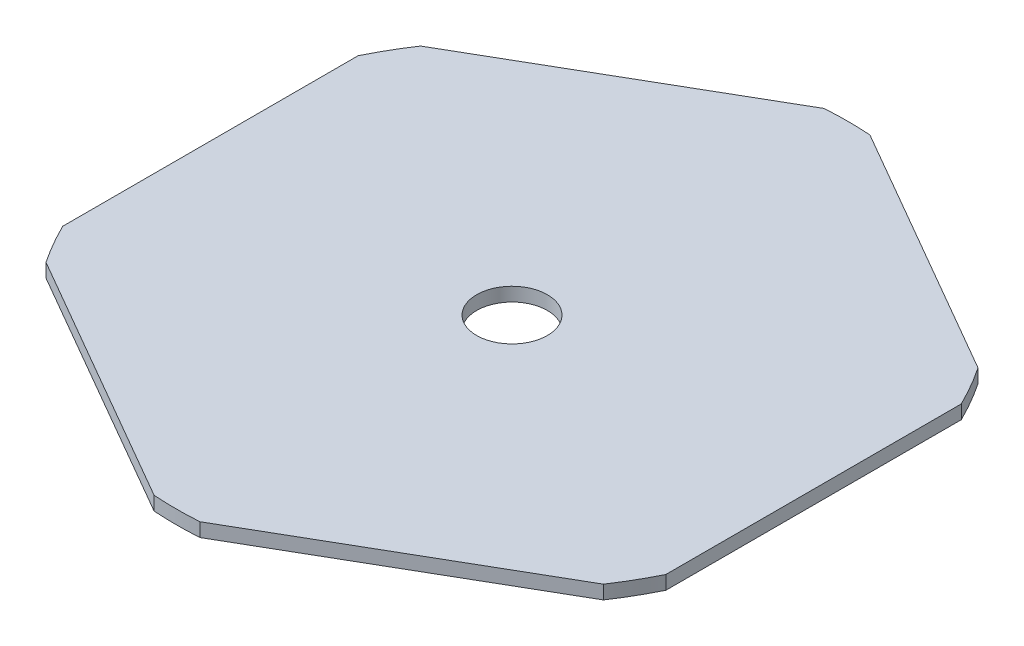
ISO-10303-21;
HEADER;
FILE_DESCRIPTION(('STEP AP214'),'2;1');
FILE_NAME('part.step','',(''),(''),'','','');
FILE_SCHEMA(('AUTOMOTIVE_DESIGN { 1 0 10303 214 1 1 1 1 }'));
ENDSEC;
DATA;
#1=APPLICATION_CONTEXT('core data for automotive mechanical design processes');
#2=APPLICATION_PROTOCOL_DEFINITION('international standard','automotive_design',2000,#1);
#3=PRODUCT_CONTEXT('',#1,'mechanical');
#4=PRODUCT('Part','Part','',(#3));
#5=PRODUCT_RELATED_PRODUCT_CATEGORY('part','',(#4));
#6=PRODUCT_DEFINITION_FORMATION('','',#4);
#7=PRODUCT_DEFINITION_CONTEXT('part definition',#1,'design');
#8=PRODUCT_DEFINITION('design','',#6,#7);
#9=PRODUCT_DEFINITION_SHAPE('','',#8);
#10=(LENGTH_UNIT() NAMED_UNIT(*) SI_UNIT(.MILLI.,.METRE.));
#11=(NAMED_UNIT(*) PLANE_ANGLE_UNIT() SI_UNIT($,.RADIAN.));
#12=(NAMED_UNIT(*) SI_UNIT($,.STERADIAN.) SOLID_ANGLE_UNIT());
#13=UNCERTAINTY_MEASURE_WITH_UNIT(LENGTH_MEASURE(1.E-05),#10,'distance_accuracy_value','');
#14=(GEOMETRIC_REPRESENTATION_CONTEXT(3) GLOBAL_UNCERTAINTY_ASSIGNED_CONTEXT((#13)) GLOBAL_UNIT_ASSIGNED_CONTEXT((#10,
#11,#12)) REPRESENTATION_CONTEXT('',''));
#15=CARTESIAN_POINT('',(0.,0.,0.));
#16=DIRECTION('',(0.,0.,1.));
#17=DIRECTION('',(1.,0.,0.));
#18=AXIS2_PLACEMENT_3D('',#15,#16,#17);
#19=CARTESIAN_POINT('',(0.,6.35,0.));
#20=DIRECTION('',(0.,-1.,0.));
#21=DIRECTION('',(0.,0.,-1.));
#22=AXIS2_PLACEMENT_3D('',#19,#20,#21);
#23=CYLINDRICAL_SURFACE('',#22,155.575);
#24=CARTESIAN_POINT('',(0.,6.35,0.));
#25=DIRECTION('',(0.,1.,0.));
#26=DIRECTION('',(0.,0.,1.));
#27=AXIS2_PLACEMENT_3D('',#24,#25,#26);
#28=CIRCLE('',#27,155.575);
#29=CARTESIAN_POINT('',(139.718923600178,6.35,-68.4266250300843));
#30=VERTEX_POINT('',#29);
#31=CARTESIAN_POINT('',(129.118657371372,6.35,-86.7868247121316));
#32=VERTEX_POINT('',#31);
#33=EDGE_CURVE('E256',#30,#32,#28,.T.);
#34=ORIENTED_EDGE('',*,*,#33,.F.);
#35=DIRECTION('',(0.,-1.,0.));
#36=VECTOR('',#35,1.);
#37=CARTESIAN_POINT('',(139.718923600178,6.35,-68.4266250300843));
#38=LINE('',#37,#36);
#39=CARTESIAN_POINT('',(139.718923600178,0.,-68.4266250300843));
#40=VERTEX_POINT('',#39);
#41=EDGE_CURVE('E220',#30,#40,#38,.T.);
#42=ORIENTED_EDGE('',*,*,#41,.T.);
#43=CARTESIAN_POINT('',(0.,0.,0.));
#44=DIRECTION('',(0.,1.,0.));
#45=DIRECTION('',(0.,0.,1.));
#46=AXIS2_PLACEMENT_3D('',#43,#44,#45);
#47=CIRCLE('',#46,155.575);
#48=CARTESIAN_POINT('',(129.118657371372,0.,-86.7868247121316));
#49=VERTEX_POINT('',#48);
#50=EDGE_CURVE('E173',#40,#49,#47,.T.);
#51=ORIENTED_EDGE('',*,*,#50,.T.);
#52=DIRECTION('',(0.,-1.,0.));
#53=VECTOR('',#52,1.);
#54=CARTESIAN_POINT('',(129.118657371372,6.35,-86.7868247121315));
#55=LINE('',#54,#53);
#56=EDGE_CURVE('E213',#49,#32,#55,.F.);
#57=ORIENTED_EDGE('',*,*,#56,.T.);
#58=EDGE_LOOP('',(#34,#42,#51,#57));
#59=FACE_BOUND('',#58,.T.);
#60=ADVANCED_FACE('F44',(#59),#23,.T.);
#61=CARTESIAN_POINT('',(10.6002662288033,6.35,-155.213449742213));
#62=VERTEX_POINT('',#61);
#63=CARTESIAN_POINT('',(-10.6002662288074,6.35,-155.213449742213));
#64=VERTEX_POINT('',#63);
#65=EDGE_CURVE('E217',#62,#64,#28,.T.);
#66=ORIENTED_EDGE('',*,*,#65,.F.);
#67=DIRECTION('',(0.,-1.,0.));
#68=VECTOR('',#67,1.);
#69=CARTESIAN_POINT('',(10.6002662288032,6.35,-155.213449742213));
#70=LINE('',#69,#68);
#71=CARTESIAN_POINT('',(10.6002662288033,0.,-155.213449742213));
#72=VERTEX_POINT('',#71);
#73=EDGE_CURVE('E211',#62,#72,#70,.T.);
#74=ORIENTED_EDGE('',*,*,#73,.T.);
#75=CARTESIAN_POINT('',(-10.6002662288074,0.,-155.213449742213));
#76=VERTEX_POINT('',#75);
#77=EDGE_CURVE('E181',#72,#76,#47,.T.);
#78=ORIENTED_EDGE('',*,*,#77,.T.);
#79=DIRECTION('',(0.,-1.,0.));
#80=VECTOR('',#79,1.);
#81=CARTESIAN_POINT('',(-10.6002662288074,6.35,-155.213449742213));
#82=LINE('',#81,#80);
#83=EDGE_CURVE('E278',#76,#64,#82,.F.);
#84=ORIENTED_EDGE('',*,*,#83,.T.);
#85=EDGE_LOOP('',(#66,#74,#78,#84));
#86=FACE_BOUND('',#85,.T.);
#87=ADVANCED_FACE('F215',(#86),#23,.T.);
#88=CARTESIAN_POINT('',(-129.118657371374,6.35,-86.7868247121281));
#89=VERTEX_POINT('',#88);
#90=CARTESIAN_POINT('',(-139.718923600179,6.35,-68.4266250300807));
#91=VERTEX_POINT('',#90);
#92=EDGE_CURVE('E258',#89,#91,#28,.T.);
#93=ORIENTED_EDGE('',*,*,#92,.F.);
#94=DIRECTION('',(0.,-1.,0.));
#95=VECTOR('',#94,1.);
#96=CARTESIAN_POINT('',(-129.118657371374,6.35,-86.7868247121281));
#97=LINE('',#96,#95);
#98=CARTESIAN_POINT('',(-129.118657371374,0.,-86.7868247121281));
#99=VERTEX_POINT('',#98);
#100=EDGE_CURVE('E198',#89,#99,#97,.T.);
#101=ORIENTED_EDGE('',*,*,#100,.T.);
#102=CARTESIAN_POINT('',(-139.718923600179,0.,-68.4266250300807));
#103=VERTEX_POINT('',#102);
#104=EDGE_CURVE('E166',#99,#103,#47,.T.);
#105=ORIENTED_EDGE('',*,*,#104,.T.);
#106=DIRECTION('',(0.,-1.,0.));
#107=VECTOR('',#106,1.);
#108=CARTESIAN_POINT('',(-139.718923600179,6.35,-68.4266250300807));
#109=LINE('',#108,#107);
#110=EDGE_CURVE('E70',#103,#91,#109,.F.);
#111=ORIENTED_EDGE('',*,*,#110,.T.);
#112=EDGE_LOOP('',(#93,#101,#105,#111));
#113=FACE_BOUND('',#112,.T.);
#114=ADVANCED_FACE('F196',(#113),#23,.T.);
#115=CARTESIAN_POINT('',(-139.718923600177,6.35,68.4266250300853));
#116=VERTEX_POINT('',#115);
#117=CARTESIAN_POINT('',(-129.118657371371,6.35,86.7868247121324));
#118=VERTEX_POINT('',#117);
#119=EDGE_CURVE('E177',#116,#118,#28,.T.);
#120=ORIENTED_EDGE('',*,*,#119,.F.);
#121=DIRECTION('',(0.,-1.,0.));
#122=VECTOR('',#121,1.);
#123=CARTESIAN_POINT('',(-139.718923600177,6.35,68.4266250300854));
#124=LINE('',#123,#122);
#125=CARTESIAN_POINT('',(-139.718923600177,0.,68.4266250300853));
#126=VERTEX_POINT('',#125);
#127=EDGE_CURVE('E267',#116,#126,#124,.T.);
#128=ORIENTED_EDGE('',*,*,#127,.T.);
#129=CARTESIAN_POINT('',(-129.118657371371,0.,86.7868247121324));
#130=VERTEX_POINT('',#129);
#131=EDGE_CURVE('E161',#126,#130,#47,.T.);
#132=ORIENTED_EDGE('',*,*,#131,.T.);
#133=DIRECTION('',(0.,-1.,0.));
#134=VECTOR('',#133,1.);
#135=CARTESIAN_POINT('',(-129.118657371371,6.35,86.7868247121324));
#136=LINE('',#135,#134);
#137=EDGE_CURVE('E62',#130,#118,#136,.F.);
#138=ORIENTED_EDGE('',*,*,#137,.T.);
#139=EDGE_LOOP('',(#120,#128,#132,#138));
#140=FACE_BOUND('',#139,.T.);
#141=ADVANCED_FACE('F266',(#140),#23,.T.);
#142=CARTESIAN_POINT('',(-10.6002662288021,6.35,155.213449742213));
#143=VERTEX_POINT('',#142);
#144=CARTESIAN_POINT('',(10.6002662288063,6.35,155.213449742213));
#145=VERTEX_POINT('',#144);
#146=EDGE_CURVE('E155',#143,#145,#28,.T.);
#147=ORIENTED_EDGE('',*,*,#146,.F.);
#148=DIRECTION('',(0.,-1.,0.));
#149=VECTOR('',#148,1.);
#150=CARTESIAN_POINT('',(-10.6002662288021,6.35,155.213449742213));
#151=LINE('',#150,#149);
#152=CARTESIAN_POINT('',(-10.6002662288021,0.,155.213449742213));
#153=VERTEX_POINT('',#152);
#154=EDGE_CURVE('E139',#143,#153,#151,.T.);
#155=ORIENTED_EDGE('',*,*,#154,.T.);
#156=CARTESIAN_POINT('',(10.6002662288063,0.,155.213449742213));
#157=VERTEX_POINT('',#156);
#158=EDGE_CURVE('E153',#153,#157,#47,.T.);
#159=ORIENTED_EDGE('',*,*,#158,.T.);
#160=DIRECTION('',(0.,-1.,0.));
#161=VECTOR('',#160,1.);
#162=CARTESIAN_POINT('',(10.6002662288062,6.35,155.213449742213));
#163=LINE('',#162,#161);
#164=EDGE_CURVE('E230',#157,#145,#163,.F.);
#165=ORIENTED_EDGE('',*,*,#164,.T.);
#166=EDGE_LOOP('',(#147,#155,#159,#165));
#167=FACE_BOUND('',#166,.T.);
#168=ADVANCED_FACE('F151',(#167),#23,.T.);
#169=CARTESIAN_POINT('',(129.118657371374,0.,86.786824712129));
#170=VERTEX_POINT('',#169);
#171=CARTESIAN_POINT('',(139.718923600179,0.,68.4266250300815));
#172=VERTEX_POINT('',#171);
#173=EDGE_CURVE('E164',#170,#172,#47,.T.);
#174=ORIENTED_EDGE('',*,*,#173,.T.);
#175=DIRECTION('',(0.,-1.,0.));
#176=VECTOR('',#175,1.);
#177=CARTESIAN_POINT('',(139.718923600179,6.35,68.4266250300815));
#178=LINE('',#177,#176);
#179=CARTESIAN_POINT('',(139.718923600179,6.35,68.4266250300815));
#180=VERTEX_POINT('',#179);
#181=EDGE_CURVE('E218',#172,#180,#178,.F.);
#182=ORIENTED_EDGE('',*,*,#181,.T.);
#183=CARTESIAN_POINT('',(129.118657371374,6.35,86.786824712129));
#184=VERTEX_POINT('',#183);
#185=EDGE_CURVE('E178',#184,#180,#28,.T.);
#186=ORIENTED_EDGE('',*,*,#185,.F.);
#187=DIRECTION('',(0.,-1.,0.));
#188=VECTOR('',#187,1.);
#189=CARTESIAN_POINT('',(129.118657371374,6.35,86.7868247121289));
#190=LINE('',#189,#188);
#191=EDGE_CURVE('E232',#184,#170,#190,.T.);
#192=ORIENTED_EDGE('',*,*,#191,.T.);
#193=EDGE_LOOP('',(#174,#182,#186,#192));
#194=FACE_BOUND('',#193,.T.);
#195=ADVANCED_FACE('F46',(#194),#23,.T.);
#196=CARTESIAN_POINT('',(0.,6.35,0.));
#197=DIRECTION('',(0.,1.,0.));
#198=DIRECTION('',(0.,0.,1.));
#199=AXIS2_PLACEMENT_3D('',#196,#197,#198);
#200=PLANE('',#199);
#201=DIRECTION('',(0.,0.,1.));
#202=VECTOR('',#201,1.);
#203=CARTESIAN_POINT('',(139.718923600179,6.35,116.509208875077));
#204=LINE('',#203,#202);
#205=EDGE_CURVE('E269',#30,#180,#204,.T.);
#206=ORIENTED_EDGE('',*,*,#205,.F.);
#207=ORIENTED_EDGE('',*,*,#33,.T.);
#208=DIRECTION('',(0.866025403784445,0.,0.499999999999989));
#209=VECTOR('',#208,1.);
#210=CARTESIAN_POINT('',(170.759396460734,6.35,-62.7455327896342));
#211=LINE('',#210,#209);
#212=EDGE_CURVE('E272',#62,#32,#211,.T.);
#213=ORIENTED_EDGE('',*,*,#212,.F.);
#214=ORIENTED_EDGE('',*,*,#65,.T.);
#215=DIRECTION('',(0.866025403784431,0.,-0.500000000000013));
#216=VECTOR('',#215,1.);
#217=CARTESIAN_POINT('',(31.0404728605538,6.35,-179.254741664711));
#218=LINE('',#217,#216);
#219=EDGE_CURVE('E281',#89,#64,#218,.T.);
#220=ORIENTED_EDGE('',*,*,#219,.F.);
#221=ORIENTED_EDGE('',*,*,#92,.T.);
#222=DIRECTION('',(0.,0.,-1.));
#223=VECTOR('',#222,1.);
#224=CARTESIAN_POINT('',(-139.71892360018,6.35,-116.509208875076));
#225=LINE('',#224,#223);
#226=EDGE_CURVE('E264',#116,#91,#225,.T.);
#227=ORIENTED_EDGE('',*,*,#226,.F.);
#228=ORIENTED_EDGE('',*,*,#119,.T.);
#229=DIRECTION('',(-0.866025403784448,0.,-0.499999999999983));
#230=VECTOR('',#229,1.);
#231=CARTESIAN_POINT('',(-170.759396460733,6.35,62.7455327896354));
#232=LINE('',#231,#230);
#233=EDGE_CURVE('E263',#143,#118,#232,.T.);
#234=ORIENTED_EDGE('',*,*,#233,.F.);
#235=ORIENTED_EDGE('',*,*,#146,.T.);
#236=DIRECTION('',(-0.866025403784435,0.,0.500000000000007));
#237=VECTOR('',#236,1.);
#238=CARTESIAN_POINT('',(-31.0404728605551,6.35,179.254741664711));
#239=LINE('',#238,#237);
#240=EDGE_CURVE('E227',#184,#145,#239,.T.);
#241=ORIENTED_EDGE('',*,*,#240,.F.);
#242=ORIENTED_EDGE('',*,*,#185,.T.);
#243=EDGE_LOOP('',(#206,#207,#213,#214,#220,#221,#227,#228,#234,#235,#241,#242));
#244=FACE_BOUND('',#243,.T.);
#245=CARTESIAN_POINT('',(0.,6.35,0.));
#246=DIRECTION('',(0.,1.,0.));
#247=DIRECTION('',(0.,0.,1.));
#248=AXIS2_PLACEMENT_3D('',#245,#246,#247);
#249=CIRCLE('',#248,16.383);
#250=CARTESIAN_POINT('',(0.,6.35,16.383));
#251=VERTEX_POINT('',#250);
#252=EDGE_CURVE('E169',#251,#251,#249,.T.);
#253=ORIENTED_EDGE('',*,*,#252,.F.);
#254=EDGE_LOOP('',(#253));
#255=FACE_BOUND('',#254,.T.);
#256=ADVANCED_FACE('F240',(#244,#255),#200,.T.);
#257=CARTESIAN_POINT('',(0.,0.,0.));
#258=DIRECTION('',(0.,1.,0.));
#259=DIRECTION('',(0.,0.,1.));
#260=AXIS2_PLACEMENT_3D('',#257,#258,#259);
#261=PLANE('',#260);
#262=CARTESIAN_POINT('',(0.,0.,0.));
#263=DIRECTION('',(0.,1.,0.));
#264=DIRECTION('',(0.,0.,1.));
#265=AXIS2_PLACEMENT_3D('',#262,#263,#264);
#266=CIRCLE('',#265,16.383);
#267=CARTESIAN_POINT('',(0.,0.,16.383));
#268=VERTEX_POINT('',#267);
#269=EDGE_CURVE('E162',#268,#268,#266,.T.);
#270=ORIENTED_EDGE('',*,*,#269,.T.);
#271=EDGE_LOOP('',(#270));
#272=FACE_BOUND('',#271,.T.);
#273=ORIENTED_EDGE('',*,*,#50,.F.);
#274=DIRECTION('',(0.,0.,1.));
#275=VECTOR('',#274,1.);
#276=CARTESIAN_POINT('',(139.718923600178,0.,-1.38056057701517E-12));
#277=LINE('',#276,#275);
#278=EDGE_CURVE('E11',#40,#172,#277,.T.);
#279=ORIENTED_EDGE('',*,*,#278,.T.);
#280=ORIENTED_EDGE('',*,*,#173,.F.);
#281=DIRECTION('',(-0.866025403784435,0.,0.500000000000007));
#282=VECTOR('',#281,1.);
#283=CARTESIAN_POINT('',(69.85946180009,0.,121.000137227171));
#284=LINE('',#283,#282);
#285=EDGE_CURVE('E147',#170,#157,#284,.T.);
#286=ORIENTED_EDGE('',*,*,#285,.T.);
#287=ORIENTED_EDGE('',*,*,#158,.F.);
#288=DIRECTION('',(-0.866025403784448,0.,-0.499999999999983));
#289=VECTOR('',#288,1.);
#290=CARTESIAN_POINT('',(-69.8594618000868,0.,121.000137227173));
#291=LINE('',#290,#289);
#292=EDGE_CURVE('E136',#153,#130,#291,.T.);
#293=ORIENTED_EDGE('',*,*,#292,.T.);
#294=ORIENTED_EDGE('',*,*,#131,.F.);
#295=DIRECTION('',(0.,0.,-1.));
#296=VECTOR('',#295,1.);
#297=CARTESIAN_POINT('',(-139.718923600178,0.,2.35781132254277E-12));
#298=LINE('',#297,#296);
#299=EDGE_CURVE('E146',#126,#103,#298,.T.);
#300=ORIENTED_EDGE('',*,*,#299,.T.);
#301=ORIENTED_EDGE('',*,*,#104,.F.);
#302=DIRECTION('',(0.866025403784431,0.,-0.500000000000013));
#303=VECTOR('',#302,1.);
#304=CARTESIAN_POINT('',(-69.8594618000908,0.,-121.00013722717));
#305=LINE('',#304,#303);
#306=EDGE_CURVE('E200',#99,#76,#305,.T.);
#307=ORIENTED_EDGE('',*,*,#306,.T.);
#308=ORIENTED_EDGE('',*,*,#77,.F.);
#309=DIRECTION('',(0.866025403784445,0.,0.49999999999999));
#310=VECTOR('',#309,1.);
#311=CARTESIAN_POINT('',(69.8594618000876,0.,-121.000137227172));
#312=LINE('',#311,#310);
#313=EDGE_CURVE('E53',#72,#49,#312,.T.);
#314=ORIENTED_EDGE('',*,*,#313,.T.);
#315=EDGE_LOOP('',(#273,#279,#280,#286,#287,#293,#294,#300,#301,#307,#308,#314));
#316=FACE_BOUND('',#315,.T.);
#317=ADVANCED_FACE('F159',(#272,#316),#261,.F.);
#318=CARTESIAN_POINT('',(0.,0.,0.));
#319=DIRECTION('',(0.,1.,0.));
#320=DIRECTION('',(0.,0.,1.));
#321=AXIS2_PLACEMENT_3D('',#318,#319,#320);
#322=CYLINDRICAL_SURFACE('',#321,16.383);
#323=ORIENTED_EDGE('',*,*,#269,.F.);
#324=EDGE_LOOP('',(#323));
#325=FACE_BOUND('',#324,.T.);
#326=ORIENTED_EDGE('',*,*,#252,.T.);
#327=EDGE_LOOP('',(#326));
#328=FACE_BOUND('',#327,.T.);
#329=ADVANCED_FACE('F238',(#325,#328),#322,.F.);
#330=CARTESIAN_POINT('',(-31.0404728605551,0.,179.254741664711));
#331=DIRECTION('',(-0.500000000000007,0.,-0.866025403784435));
#332=DIRECTION('',(-0.866025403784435,0.,0.500000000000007));
#333=AXIS2_PLACEMENT_3D('',#330,#331,#332);
#334=PLANE('',#333);
#335=ORIENTED_EDGE('',*,*,#240,.T.);
#336=ORIENTED_EDGE('',*,*,#164,.F.);
#337=ORIENTED_EDGE('',*,*,#285,.F.);
#338=ORIENTED_EDGE('',*,*,#191,.F.);
#339=EDGE_LOOP('',(#335,#336,#337,#338));
#340=FACE_BOUND('',#339,.T.);
#341=ADVANCED_FACE('F294',(#340),#334,.F.);
#342=CARTESIAN_POINT('',(-170.759396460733,0.,62.7455327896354));
#343=DIRECTION('',(0.499999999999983,0.,-0.866025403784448));
#344=DIRECTION('',(-0.866025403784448,0.,-0.499999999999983));
#345=AXIS2_PLACEMENT_3D('',#342,#343,#344);
#346=PLANE('',#345);
#347=ORIENTED_EDGE('',*,*,#233,.T.);
#348=ORIENTED_EDGE('',*,*,#137,.F.);
#349=ORIENTED_EDGE('',*,*,#292,.F.);
#350=ORIENTED_EDGE('',*,*,#154,.F.);
#351=EDGE_LOOP('',(#347,#348,#349,#350));
#352=FACE_BOUND('',#351,.T.);
#353=ADVANCED_FACE('F138',(#352),#346,.F.);
#354=CARTESIAN_POINT('',(-139.71892360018,0.,-116.509208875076));
#355=DIRECTION('',(1.,0.,0.));
#356=DIRECTION('',(0.,0.,-1.));
#357=AXIS2_PLACEMENT_3D('',#354,#355,#356);
#358=PLANE('',#357);
#359=ORIENTED_EDGE('',*,*,#226,.T.);
#360=ORIENTED_EDGE('',*,*,#110,.F.);
#361=ORIENTED_EDGE('',*,*,#299,.F.);
#362=ORIENTED_EDGE('',*,*,#127,.F.);
#363=EDGE_LOOP('',(#359,#360,#361,#362));
#364=FACE_BOUND('',#363,.T.);
#365=ADVANCED_FACE('F286',(#364),#358,.F.);
#366=CARTESIAN_POINT('',(31.0404728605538,0.,-179.254741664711));
#367=DIRECTION('',(0.500000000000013,0.,0.866025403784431));
#368=DIRECTION('',(0.866025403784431,0.,-0.500000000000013));
#369=AXIS2_PLACEMENT_3D('',#366,#367,#368);
#370=PLANE('',#369);
#371=ORIENTED_EDGE('',*,*,#219,.T.);
#372=ORIENTED_EDGE('',*,*,#83,.F.);
#373=ORIENTED_EDGE('',*,*,#306,.F.);
#374=ORIENTED_EDGE('',*,*,#100,.F.);
#375=EDGE_LOOP('',(#371,#372,#373,#374));
#376=FACE_BOUND('',#375,.T.);
#377=ADVANCED_FACE('F280',(#376),#370,.F.);
#378=CARTESIAN_POINT('',(170.759396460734,0.,-62.7455327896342));
#379=DIRECTION('',(-0.499999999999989,0.,0.866025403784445));
#380=DIRECTION('',(0.866025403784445,0.,0.49999999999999));
#381=AXIS2_PLACEMENT_3D('',#378,#379,#380);
#382=PLANE('',#381);
#383=ORIENTED_EDGE('',*,*,#212,.T.);
#384=ORIENTED_EDGE('',*,*,#56,.F.);
#385=ORIENTED_EDGE('',*,*,#313,.F.);
#386=ORIENTED_EDGE('',*,*,#73,.F.);
#387=EDGE_LOOP('',(#383,#384,#385,#386));
#388=FACE_BOUND('',#387,.T.);
#389=ADVANCED_FACE('F210',(#388),#382,.F.);
#390=CARTESIAN_POINT('',(139.718923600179,0.,116.509208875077));
#391=DIRECTION('',(-1.,0.,0.));
#392=DIRECTION('',(0.,0.,1.));
#393=AXIS2_PLACEMENT_3D('',#390,#391,#392);
#394=PLANE('',#393);
#395=ORIENTED_EDGE('',*,*,#205,.T.);
#396=ORIENTED_EDGE('',*,*,#181,.F.);
#397=ORIENTED_EDGE('',*,*,#278,.F.);
#398=ORIENTED_EDGE('',*,*,#41,.F.);
#399=EDGE_LOOP('',(#395,#396,#397,#398));
#400=FACE_BOUND('',#399,.T.);
#401=ADVANCED_FACE('F299',(#400),#394,.F.);
#402=CLOSED_SHELL('',(#60,#87,#114,#141,#168,#195,#256,#317,#329,#341,#353,#365,#377,#389,#401));
#403=MANIFOLD_SOLID_BREP('B2',#402);
#404=ADVANCED_BREP_SHAPE_REPRESENTATION('',(#18,#403),#14);
#405=SHAPE_DEFINITION_REPRESENTATION(#9,#404);
ENDSEC;
END-ISO-10303-21;
